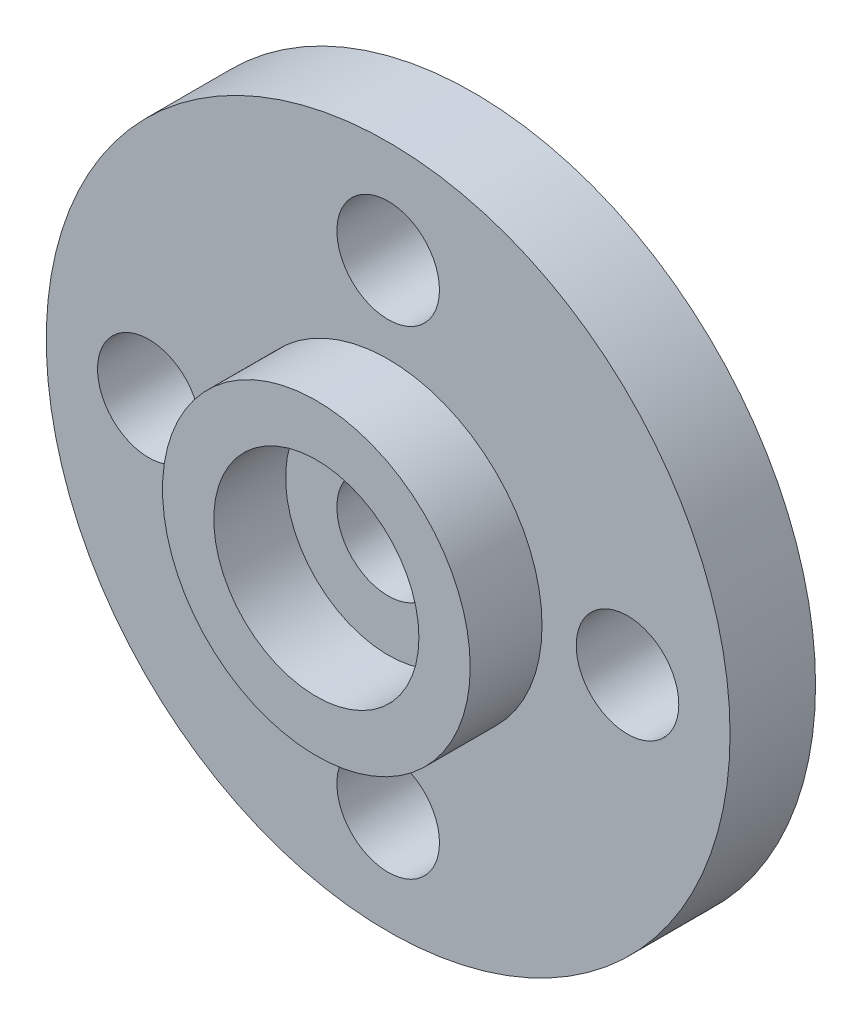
from build123d import *

# Parameters (mm, degrees)
SKETCH_1_R          = 10
EXTRUDE_1_DEPTH     = 2.5
SKETCH_2_R          = 4.5
SKETCH_2_R_2        = 3
EXTRUDE_2_DEPTH     = 2.1
SKETCH_3_R          = 1.5
CUT_EXTRUDE_1_DEPTH = 3
SKETCH_4_R          = 1.5
CUT_EXTRUDE_2_DEPTH = 3


with BuildPart() as part:
    # Sketch 1 → Extrude 1 (new body)
    with BuildSketch(Plane.XY):
        Circle(SKETCH_1_R)
    extrude(amount=EXTRUDE_1_DEPTH)

    # Sketch 2 → Extrude 2 (add)
    with BuildSketch(Plane.XY.offset(2.5)):
        Circle(SKETCH_2_R)
        Circle(SKETCH_2_R_2, mode=Mode.SUBTRACT)
    extrude(amount=EXTRUDE_2_DEPTH)

    # Sketch 3 → Cut-Extrude 1 (cut)
    with BuildSketch(Plane.XY.offset(2.5)):
        Circle(SKETCH_3_R)
    extrude(amount=-CUT_EXTRUDE_1_DEPTH, mode=Mode.SUBTRACT)

    # Sketch 4 → Cut-Extrude 2 (cut)
    with BuildSketch(Plane.XY.offset(2.5)):
        with Locations((0, 7)):
            Circle(SKETCH_4_R)
        with Locations((7, 0)):
            Circle(SKETCH_4_R)
        with Locations((0, -7)):
            Circle(SKETCH_4_R)
        with Locations((-7, 0)):
            Circle(SKETCH_4_R)
    extrude(amount=-CUT_EXTRUDE_2_DEPTH, mode=Mode.SUBTRACT)


solid = part.part
